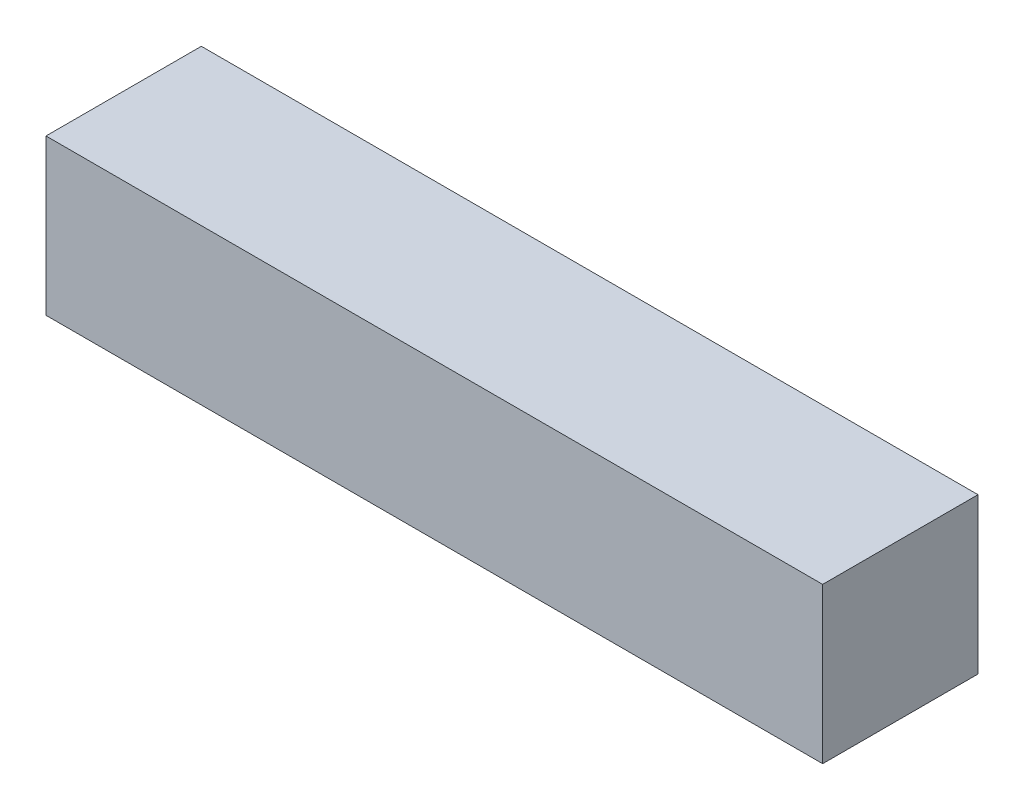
ISO-10303-21;
HEADER;
FILE_DESCRIPTION(('STEP AP214'),'2;1');
FILE_NAME('part.step','',(''),(''),'','','');
FILE_SCHEMA(('AUTOMOTIVE_DESIGN { 1 0 10303 214 1 1 1 1 }'));
ENDSEC;
DATA;
#1=APPLICATION_CONTEXT('core data for automotive mechanical design processes');
#2=APPLICATION_PROTOCOL_DEFINITION('international standard','automotive_design',2000,#1);
#3=PRODUCT_CONTEXT('',#1,'mechanical');
#4=PRODUCT('Part','Part','',(#3));
#5=PRODUCT_RELATED_PRODUCT_CATEGORY('part','',(#4));
#6=PRODUCT_DEFINITION_FORMATION('','',#4);
#7=PRODUCT_DEFINITION_CONTEXT('part definition',#1,'design');
#8=PRODUCT_DEFINITION('design','',#6,#7);
#9=PRODUCT_DEFINITION_SHAPE('','',#8);
#10=(LENGTH_UNIT() NAMED_UNIT(*) SI_UNIT(.MILLI.,.METRE.));
#11=(NAMED_UNIT(*) PLANE_ANGLE_UNIT() SI_UNIT($,.RADIAN.));
#12=(NAMED_UNIT(*) SI_UNIT($,.STERADIAN.) SOLID_ANGLE_UNIT());
#13=UNCERTAINTY_MEASURE_WITH_UNIT(LENGTH_MEASURE(1.E-05),#10,'distance_accuracy_value','');
#14=(GEOMETRIC_REPRESENTATION_CONTEXT(3) GLOBAL_UNCERTAINTY_ASSIGNED_CONTEXT((#13)) GLOBAL_UNIT_ASSIGNED_CONTEXT((#10,
#11,#12)) REPRESENTATION_CONTEXT('',''));
#15=CARTESIAN_POINT('',(0.,0.,0.));
#16=DIRECTION('',(0.,0.,1.));
#17=DIRECTION('',(1.,0.,0.));
#18=AXIS2_PLACEMENT_3D('',#15,#16,#17);
#19=CARTESIAN_POINT('',(-200.,-40.0000000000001,80.));
#20=DIRECTION('',(1.,0.,0.));
#21=DIRECTION('',(0.,1.,0.));
#22=AXIS2_PLACEMENT_3D('',#19,#20,#21);
#23=PLANE('',#22);
#24=DIRECTION('',(0.,-1.,0.));
#25=VECTOR('',#24,1.);
#26=CARTESIAN_POINT('',(-200.,-40.0000000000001,0.));
#27=LINE('',#26,#25);
#28=CARTESIAN_POINT('',(-200.,40.,0.));
#29=VERTEX_POINT('',#28);
#30=CARTESIAN_POINT('',(-200.,-40.0000000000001,0.));
#31=VERTEX_POINT('',#30);
#32=EDGE_CURVE('E102',#29,#31,#27,.T.);
#33=ORIENTED_EDGE('',*,*,#32,.T.);
#34=DIRECTION('',(0.,0.,-1.));
#35=VECTOR('',#34,1.);
#36=CARTESIAN_POINT('',(-200.,-40.0000000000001,80.));
#37=LINE('',#36,#35);
#38=CARTESIAN_POINT('',(-200.,-40.0000000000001,80.));
#39=VERTEX_POINT('',#38);
#40=EDGE_CURVE('E11',#39,#31,#37,.T.);
#41=ORIENTED_EDGE('',*,*,#40,.F.);
#42=DIRECTION('',(0.,-1.,0.));
#43=VECTOR('',#42,1.);
#44=CARTESIAN_POINT('',(-200.,-40.0000000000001,80.));
#45=LINE('',#44,#43);
#46=CARTESIAN_POINT('',(-200.,40.,80.));
#47=VERTEX_POINT('',#46);
#48=EDGE_CURVE('E95',#47,#39,#45,.T.);
#49=ORIENTED_EDGE('',*,*,#48,.F.);
#50=DIRECTION('',(0.,0.,-1.));
#51=VECTOR('',#50,1.);
#52=CARTESIAN_POINT('',(-200.,40.,80.));
#53=LINE('',#52,#51);
#54=EDGE_CURVE('E99',#47,#29,#53,.T.);
#55=ORIENTED_EDGE('',*,*,#54,.T.);
#56=EDGE_LOOP('',(#33,#41,#49,#55));
#57=FACE_BOUND('',#56,.T.);
#58=ADVANCED_FACE('F41',(#57),#23,.F.);
#59=CARTESIAN_POINT('',(200.,-40.,80.));
#60=DIRECTION('',(0.,1.,0.));
#61=DIRECTION('',(-1.,0.,0.));
#62=AXIS2_PLACEMENT_3D('',#59,#60,#61);
#63=PLANE('',#62);
#64=DIRECTION('',(1.,0.,0.));
#65=VECTOR('',#64,1.);
#66=CARTESIAN_POINT('',(200.,-40.,0.));
#67=LINE('',#66,#65);
#68=CARTESIAN_POINT('',(200.,-40.,0.));
#69=VERTEX_POINT('',#68);
#70=EDGE_CURVE('E96',#31,#69,#67,.T.);
#71=ORIENTED_EDGE('',*,*,#70,.T.);
#72=DIRECTION('',(0.,0.,-1.));
#73=VECTOR('',#72,1.);
#74=CARTESIAN_POINT('',(200.,-40.,80.));
#75=LINE('',#74,#73);
#76=CARTESIAN_POINT('',(200.,-40.,80.));
#77=VERTEX_POINT('',#76);
#78=EDGE_CURVE('E47',#77,#69,#75,.T.);
#79=ORIENTED_EDGE('',*,*,#78,.F.);
#80=DIRECTION('',(1.,0.,0.));
#81=VECTOR('',#80,1.);
#82=CARTESIAN_POINT('',(200.,-40.,80.));
#83=LINE('',#82,#81);
#84=EDGE_CURVE('E87',#39,#77,#83,.T.);
#85=ORIENTED_EDGE('',*,*,#84,.F.);
#86=ORIENTED_EDGE('',*,*,#40,.T.);
#87=EDGE_LOOP('',(#71,#79,#85,#86));
#88=FACE_BOUND('',#87,.T.);
#89=ADVANCED_FACE('F92',(#88),#63,.F.);
#90=CARTESIAN_POINT('',(200.,-40.,80.));
#91=DIRECTION('',(-1.,0.,0.));
#92=DIRECTION('',(0.,-1.,0.));
#93=AXIS2_PLACEMENT_3D('',#90,#91,#92);
#94=PLANE('',#93);
#95=DIRECTION('',(0.,1.,0.));
#96=VECTOR('',#95,1.);
#97=CARTESIAN_POINT('',(200.,-40.,0.));
#98=LINE('',#97,#96);
#99=CARTESIAN_POINT('',(200.,40.,0.));
#100=VERTEX_POINT('',#99);
#101=EDGE_CURVE('E74',#69,#100,#98,.T.);
#102=ORIENTED_EDGE('',*,*,#101,.T.);
#103=DIRECTION('',(0.,0.,-1.));
#104=VECTOR('',#103,1.);
#105=CARTESIAN_POINT('',(200.,40.,80.));
#106=LINE('',#105,#104);
#107=CARTESIAN_POINT('',(200.,40.,80.));
#108=VERTEX_POINT('',#107);
#109=EDGE_CURVE('E100',#108,#100,#106,.T.);
#110=ORIENTED_EDGE('',*,*,#109,.F.);
#111=DIRECTION('',(0.,1.,0.));
#112=VECTOR('',#111,1.);
#113=CARTESIAN_POINT('',(200.,-40.,80.));
#114=LINE('',#113,#112);
#115=EDGE_CURVE('E89',#77,#108,#114,.T.);
#116=ORIENTED_EDGE('',*,*,#115,.F.);
#117=ORIENTED_EDGE('',*,*,#78,.T.);
#118=EDGE_LOOP('',(#102,#110,#116,#117));
#119=FACE_BOUND('',#118,.T.);
#120=ADVANCED_FACE('F98',(#119),#94,.F.);
#121=CARTESIAN_POINT('',(200.,40.,80.));
#122=DIRECTION('',(0.,-1.,0.));
#123=DIRECTION('',(0.,0.,-1.));
#124=AXIS2_PLACEMENT_3D('',#121,#122,#123);
#125=PLANE('',#124);
#126=DIRECTION('',(-1.,0.,0.));
#127=VECTOR('',#126,1.);
#128=CARTESIAN_POINT('',(200.,40.,0.));
#129=LINE('',#128,#127);
#130=EDGE_CURVE('E79',#100,#29,#129,.T.);
#131=ORIENTED_EDGE('',*,*,#130,.T.);
#132=ORIENTED_EDGE('',*,*,#54,.F.);
#133=DIRECTION('',(-1.,0.,0.));
#134=VECTOR('',#133,1.);
#135=CARTESIAN_POINT('',(200.,40.,80.));
#136=LINE('',#135,#134);
#137=EDGE_CURVE('E60',#108,#47,#136,.T.);
#138=ORIENTED_EDGE('',*,*,#137,.F.);
#139=ORIENTED_EDGE('',*,*,#109,.T.);
#140=EDGE_LOOP('',(#131,#132,#138,#139));
#141=FACE_BOUND('',#140,.T.);
#142=ADVANCED_FACE('F112',(#141),#125,.F.);
#143=CARTESIAN_POINT('',(0.,0.,80.));
#144=DIRECTION('',(0.,0.,1.));
#145=DIRECTION('',(1.,0.,0.));
#146=AXIS2_PLACEMENT_3D('',#143,#144,#145);
#147=PLANE('',#146);
#148=ORIENTED_EDGE('',*,*,#48,.T.);
#149=ORIENTED_EDGE('',*,*,#84,.T.);
#150=ORIENTED_EDGE('',*,*,#115,.T.);
#151=ORIENTED_EDGE('',*,*,#137,.T.);
#152=EDGE_LOOP('',(#148,#149,#150,#151));
#153=FACE_BOUND('',#152,.T.);
#154=ADVANCED_FACE('F86',(#153),#147,.T.);
#155=CARTESIAN_POINT('',(0.,0.,0.));
#156=DIRECTION('',(0.,0.,1.));
#157=DIRECTION('',(1.,0.,0.));
#158=AXIS2_PLACEMENT_3D('',#155,#156,#157);
#159=PLANE('',#158);
#160=ORIENTED_EDGE('',*,*,#32,.F.);
#161=ORIENTED_EDGE('',*,*,#130,.F.);
#162=ORIENTED_EDGE('',*,*,#101,.F.);
#163=ORIENTED_EDGE('',*,*,#70,.F.);
#164=EDGE_LOOP('',(#160,#161,#162,#163));
#165=FACE_BOUND('',#164,.T.);
#166=ADVANCED_FACE('F111',(#165),#159,.F.);
#167=CLOSED_SHELL('',(#58,#89,#120,#142,#154,#166));
#168=MANIFOLD_SOLID_BREP('B2',#167);
#169=ADVANCED_BREP_SHAPE_REPRESENTATION('',(#18,#168),#14);
#170=SHAPE_DEFINITION_REPRESENTATION(#9,#169);
ENDSEC;
END-ISO-10303-21;
